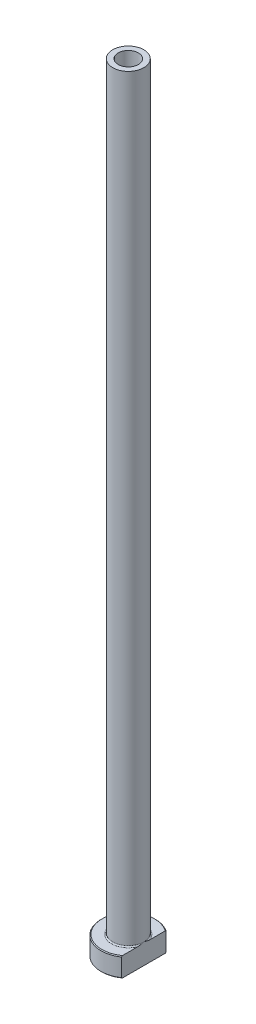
ISO-10303-21;
HEADER;
FILE_DESCRIPTION(('STEP AP214'),'2;1');
FILE_NAME('part.step','',(''),(''),'','','');
FILE_SCHEMA(('AUTOMOTIVE_DESIGN { 1 0 10303 214 1 1 1 1 }'));
ENDSEC;
DATA;
#1=APPLICATION_CONTEXT('core data for automotive mechanical design processes');
#2=APPLICATION_PROTOCOL_DEFINITION('international standard','automotive_design',2000,#1);
#3=PRODUCT_CONTEXT('',#1,'mechanical');
#4=PRODUCT('Part','Part','',(#3));
#5=PRODUCT_RELATED_PRODUCT_CATEGORY('part','',(#4));
#6=PRODUCT_DEFINITION_FORMATION('','',#4);
#7=PRODUCT_DEFINITION_CONTEXT('part definition',#1,'design');
#8=PRODUCT_DEFINITION('design','',#6,#7);
#9=PRODUCT_DEFINITION_SHAPE('','',#8);
#10=(LENGTH_UNIT() NAMED_UNIT(*) SI_UNIT(.MILLI.,.METRE.));
#11=(NAMED_UNIT(*) PLANE_ANGLE_UNIT() SI_UNIT($,.RADIAN.));
#12=(NAMED_UNIT(*) SI_UNIT($,.STERADIAN.) SOLID_ANGLE_UNIT());
#13=UNCERTAINTY_MEASURE_WITH_UNIT(LENGTH_MEASURE(1.E-05),#10,'distance_accuracy_value','');
#14=(GEOMETRIC_REPRESENTATION_CONTEXT(3) GLOBAL_UNCERTAINTY_ASSIGNED_CONTEXT((#13)) GLOBAL_UNIT_ASSIGNED_CONTEXT((#10,
#11,#12)) REPRESENTATION_CONTEXT('',''));
#15=CARTESIAN_POINT('',(0.,0.,0.));
#16=DIRECTION('',(0.,0.,1.));
#17=DIRECTION('',(1.,0.,0.));
#18=AXIS2_PLACEMENT_3D('',#15,#16,#17);
#19=CARTESIAN_POINT('',(0.,92.1876809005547,0.));
#20=DIRECTION('',(0.,1.,0.));
#21=DIRECTION('',(0.,0.,1.));
#22=AXIS2_PLACEMENT_3D('',#19,#20,#21);
#23=CYLINDRICAL_SURFACE('',#22,2.6);
#24=CARTESIAN_POINT('',(0.,200.,0.));
#25=DIRECTION('',(0.,1.,0.));
#26=DIRECTION('',(0.,0.,1.));
#27=AXIS2_PLACEMENT_3D('',#24,#25,#26);
#28=CIRCLE('',#27,2.6);
#29=CARTESIAN_POINT('',(0.,200.,2.6));
#30=VERTEX_POINT('',#29);
#31=EDGE_CURVE('E167',#30,#30,#28,.T.);
#32=ORIENTED_EDGE('',*,*,#31,.T.);
#33=EDGE_LOOP('',(#32));
#34=FACE_BOUND('',#33,.T.);
#35=CARTESIAN_POINT('',(0.,155.,0.));
#36=DIRECTION('',(0.,1.,0.));
#37=DIRECTION('',(0.,0.,1.));
#38=AXIS2_PLACEMENT_3D('',#35,#36,#37);
#39=CIRCLE('',#38,2.6);
#40=CARTESIAN_POINT('',(0.,155.,2.6));
#41=VERTEX_POINT('',#40);
#42=EDGE_CURVE('E170',#41,#41,#39,.T.);
#43=ORIENTED_EDGE('',*,*,#42,.F.);
#44=EDGE_LOOP('',(#43));
#45=FACE_BOUND('',#44,.T.);
#46=ADVANCED_FACE('F32',(#34,#45),#23,.F.);
#47=CARTESIAN_POINT('',(-2.6,200.,0.));
#48=DIRECTION('',(0.,1.,0.));
#49=DIRECTION('',(0.,0.,1.));
#50=AXIS2_PLACEMENT_3D('',#47,#48,#49);
#51=PLANE('',#50);
#52=CARTESIAN_POINT('',(0.,200.,0.));
#53=DIRECTION('',(0.,1.,0.));
#54=DIRECTION('',(0.,0.,1.));
#55=AXIS2_PLACEMENT_3D('',#52,#53,#54);
#56=CIRCLE('',#55,4.00000000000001);
#57=CARTESIAN_POINT('',(0.,200.,4.00000000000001));
#58=VERTEX_POINT('',#57);
#59=EDGE_CURVE('E174',#58,#58,#56,.T.);
#60=ORIENTED_EDGE('',*,*,#59,.T.);
#61=EDGE_LOOP('',(#60));
#62=FACE_BOUND('',#61,.T.);
#63=ORIENTED_EDGE('',*,*,#31,.F.);
#64=EDGE_LOOP('',(#63));
#65=FACE_BOUND('',#64,.T.);
#66=ADVANCED_FACE('F157',(#62,#65),#51,.T.);
#67=CARTESIAN_POINT('',(0.,92.1876809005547,0.));
#68=DIRECTION('',(0.,1.,0.));
#69=DIRECTION('',(0.,0.,1.));
#70=AXIS2_PLACEMENT_3D('',#67,#68,#69);
#71=CYLINDRICAL_SURFACE('',#70,4.);
#72=CARTESIAN_POINT('',(0.,5.3,0.));
#73=DIRECTION('',(0.,1.,0.));
#74=DIRECTION('',(0.,0.,1.));
#75=AXIS2_PLACEMENT_3D('',#72,#73,#74);
#76=CIRCLE('',#75,4.);
#77=CARTESIAN_POINT('',(4.,5.3,0.));
#78=VERTEX_POINT('',#77);
#79=EDGE_CURVE('E180',#78,#78,#76,.T.);
#80=ORIENTED_EDGE('',*,*,#79,.T.);
#81=EDGE_LOOP('',(#80));
#82=FACE_BOUND('',#81,.T.);
#83=ORIENTED_EDGE('',*,*,#59,.F.);
#84=EDGE_LOOP('',(#83));
#85=FACE_BOUND('',#84,.T.);
#86=ADVANCED_FACE('F162',(#82,#85),#71,.T.);
#87=CARTESIAN_POINT('',(-3.99999999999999,5.,0.));
#88=DIRECTION('',(0.,1.,0.));
#89=DIRECTION('',(0.,0.,1.));
#90=AXIS2_PLACEMENT_3D('',#87,#88,#89);
#91=PLANE('',#90);
#92=DIRECTION('',(0.,0.,1.));
#93=VECTOR('',#92,1.);
#94=CARTESIAN_POINT('',(4.,5.,0.));
#95=LINE('',#94,#93);
#96=CARTESIAN_POINT('',(4.,5.,-5.49909083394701));
#97=VERTEX_POINT('',#96);
#98=CARTESIAN_POINT('',(4.,5.,-1.57797338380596));
#99=VERTEX_POINT('',#98);
#100=EDGE_CURVE('E54',#97,#99,#95,.T.);
#101=ORIENTED_EDGE('',*,*,#100,.F.);
#102=CARTESIAN_POINT('',(0.,5.,0.));
#103=DIRECTION('',(0.,1.,0.));
#104=DIRECTION('',(0.,0.,1.));
#105=AXIS2_PLACEMENT_3D('',#102,#103,#104);
#106=CIRCLE('',#105,6.8);
#107=CARTESIAN_POINT('',(3.99999999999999,5.,5.49909083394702));
#108=VERTEX_POINT('',#107);
#109=EDGE_CURVE('E186',#97,#108,#106,.T.);
#110=ORIENTED_EDGE('',*,*,#109,.T.);
#111=CARTESIAN_POINT('',(4.,5.,1.57797338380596));
#112=VERTEX_POINT('',#111);
#113=EDGE_CURVE('E134',#112,#108,#95,.T.);
#114=ORIENTED_EDGE('',*,*,#113,.F.);
#115=CARTESIAN_POINT('',(0.,5.,0.));
#116=DIRECTION('',(0.,1.,0.));
#117=DIRECTION('',(0.,0.,1.));
#118=AXIS2_PLACEMENT_3D('',#115,#116,#117);
#119=CIRCLE('',#118,4.3);
#120=EDGE_CURVE('E183',#112,#99,#119,.F.);
#121=ORIENTED_EDGE('',*,*,#120,.T.);
#122=EDGE_LOOP('',(#101,#110,#114,#121));
#123=FACE_BOUND('',#122,.T.);
#124=ADVANCED_FACE('F197',(#123),#91,.T.);
#125=CARTESIAN_POINT('',(0.,92.1876809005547,0.));
#126=DIRECTION('',(0.,1.,0.));
#127=DIRECTION('',(0.,0.,1.));
#128=AXIS2_PLACEMENT_3D('',#125,#126,#127);
#129=CYLINDRICAL_SURFACE('',#128,6.99999999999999);
#130=DIRECTION('',(0.,-1.,0.));
#131=VECTOR('',#130,1.);
#132=CARTESIAN_POINT('',(3.99999999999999,200.,5.74456264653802));
#133=LINE('',#132,#131);
#134=CARTESIAN_POINT('',(3.99999999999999,4.8,5.74456264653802));
#135=VERTEX_POINT('',#134);
#136=CARTESIAN_POINT('',(3.99999999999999,0.20000000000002,5.74456264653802));
#137=VERTEX_POINT('',#136);
#138=EDGE_CURVE('E82',#135,#137,#133,.T.);
#139=ORIENTED_EDGE('',*,*,#138,.F.);
#140=CARTESIAN_POINT('',(0.,4.8,0.));
#141=DIRECTION('',(0.,1.,0.));
#142=DIRECTION('',(0.,0.,1.));
#143=AXIS2_PLACEMENT_3D('',#140,#141,#142);
#144=CIRCLE('',#143,6.99999999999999);
#145=CARTESIAN_POINT('',(4.,4.8,-5.74456264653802));
#146=VERTEX_POINT('',#145);
#147=EDGE_CURVE('E95',#135,#146,#144,.F.);
#148=ORIENTED_EDGE('',*,*,#147,.T.);
#149=DIRECTION('',(0.,-1.,0.));
#150=VECTOR('',#149,1.);
#151=CARTESIAN_POINT('',(4.,200.,-5.74456264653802));
#152=LINE('',#151,#150);
#153=CARTESIAN_POINT('',(4.,0.20000000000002,-5.74456264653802));
#154=VERTEX_POINT('',#153);
#155=EDGE_CURVE('E192',#146,#154,#152,.T.);
#156=ORIENTED_EDGE('',*,*,#155,.T.);
#157=CARTESIAN_POINT('',(0.,0.20000000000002,0.));
#158=DIRECTION('',(0.,-1.,0.));
#159=DIRECTION('',(0.,0.,-1.));
#160=AXIS2_PLACEMENT_3D('',#157,#158,#159);
#161=CIRCLE('',#160,6.99999999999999);
#162=EDGE_CURVE('E98',#154,#137,#161,.F.);
#163=ORIENTED_EDGE('',*,*,#162,.T.);
#164=EDGE_LOOP('',(#139,#148,#156,#163));
#165=FACE_BOUND('',#164,.T.);
#166=ADVANCED_FACE('F190',(#165),#129,.T.);
#167=CARTESIAN_POINT('',(-6.99999999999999,0.,0.));
#168=DIRECTION('',(0.,-1.,0.));
#169=DIRECTION('',(0.,0.,-1.));
#170=AXIS2_PLACEMENT_3D('',#167,#168,#169);
#171=PLANE('',#170);
#172=CARTESIAN_POINT('',(0.,0.,0.));
#173=DIRECTION('',(0.,-1.,0.));
#174=DIRECTION('',(0.,0.,-1.));
#175=AXIS2_PLACEMENT_3D('',#172,#173,#174);
#176=CIRCLE('',#175,3.34999999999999);
#177=CARTESIAN_POINT('',(0.,0.,-3.34999999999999));
#178=VERTEX_POINT('',#177);
#179=EDGE_CURVE('E40',#178,#178,#176,.F.);
#180=ORIENTED_EDGE('',*,*,#179,.T.);
#181=EDGE_LOOP('',(#180));
#182=FACE_BOUND('',#181,.T.);
#183=DIRECTION('',(0.,0.,-1.));
#184=VECTOR('',#183,1.);
#185=CARTESIAN_POINT('',(3.99999999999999,0.,5.74456264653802));
#186=LINE('',#185,#184);
#187=CARTESIAN_POINT('',(3.99999999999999,0.,5.49909083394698));
#188=VERTEX_POINT('',#187);
#189=CARTESIAN_POINT('',(4.,0.,-5.49909083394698));
#190=VERTEX_POINT('',#189);
#191=EDGE_CURVE('E47',#188,#190,#186,.T.);
#192=ORIENTED_EDGE('',*,*,#191,.F.);
#193=CARTESIAN_POINT('',(0.,0.,0.));
#194=DIRECTION('',(0.,-1.,0.));
#195=DIRECTION('',(0.,0.,-1.));
#196=AXIS2_PLACEMENT_3D('',#193,#194,#195);
#197=CIRCLE('',#196,6.79999999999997);
#198=EDGE_CURVE('E92',#188,#190,#197,.T.);
#199=ORIENTED_EDGE('',*,*,#198,.T.);
#200=EDGE_LOOP('',(#192,#199));
#201=FACE_BOUND('',#200,.T.);
#202=ADVANCED_FACE('F91',(#182,#201),#171,.T.);
#203=CARTESIAN_POINT('',(0.,92.1876809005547,0.));
#204=DIRECTION('',(0.,1.,0.));
#205=DIRECTION('',(0.,0.,1.));
#206=AXIS2_PLACEMENT_3D('',#203,#204,#205);
#207=CYLINDRICAL_SURFACE('',#206,2.85);
#208=CARTESIAN_POINT('',(0.,0.500000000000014,0.));
#209=DIRECTION('',(0.,-1.,0.));
#210=DIRECTION('',(0.,0.,-1.));
#211=AXIS2_PLACEMENT_3D('',#208,#209,#210);
#212=CIRCLE('',#211,2.85);
#213=CARTESIAN_POINT('',(0.,0.500000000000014,-2.85));
#214=VERTEX_POINT('',#213);
#215=EDGE_CURVE('E11',#214,#214,#212,.T.);
#216=ORIENTED_EDGE('',*,*,#215,.T.);
#217=EDGE_LOOP('',(#216));
#218=FACE_BOUND('',#217,.T.);
#219=CARTESIAN_POINT('',(0.,143.,0.));
#220=DIRECTION('',(0.,1.,0.));
#221=DIRECTION('',(0.,0.,1.));
#222=AXIS2_PLACEMENT_3D('',#219,#220,#221);
#223=CIRCLE('',#222,2.85000000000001);
#224=CARTESIAN_POINT('',(0.,143.,2.85000000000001));
#225=VERTEX_POINT('',#224);
#226=EDGE_CURVE('E172',#225,#225,#223,.T.);
#227=ORIENTED_EDGE('',*,*,#226,.T.);
#228=EDGE_LOOP('',(#227));
#229=FACE_BOUND('',#228,.T.);
#230=ADVANCED_FACE('F215',(#218,#229),#207,.F.);
#231=CARTESIAN_POINT('',(0.,143.,0.));
#232=DIRECTION('',(0.,-1.,0.));
#233=DIRECTION('',(0.,0.,-1.));
#234=AXIS2_PLACEMENT_3D('',#231,#232,#233);
#235=CONICAL_SURFACE('',#234,2.85000000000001,0.0208303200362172);
#236=ORIENTED_EDGE('',*,*,#42,.T.);
#237=EDGE_LOOP('',(#236));
#238=FACE_BOUND('',#237,.T.);
#239=ORIENTED_EDGE('',*,*,#226,.F.);
#240=EDGE_LOOP('',(#239));
#241=FACE_BOUND('',#240,.T.);
#242=ADVANCED_FACE('F111',(#238,#241),#235,.F.);
#243=CARTESIAN_POINT('',(0.,5.3,0.));
#244=DIRECTION('',(0.,1.,0.));
#245=DIRECTION('',(0.,0.,1.));
#246=AXIS2_PLACEMENT_3D('',#243,#244,#245);
#247=TOROIDAL_SURFACE('',#246,4.3,0.3);
#248=ORIENTED_EDGE('',*,*,#120,.F.);
#249=CARTESIAN_POINT('',(4.,5.3,0.));
#250=CARTESIAN_POINT('',(4.,5.30000062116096,-1.06261387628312E-10));
#251=CARTESIAN_POINT('',(4.,5.30000124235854,2.17726101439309E-07));
#252=CARTESIAN_POINT('',(4.,5.30000240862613,8.36141079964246E-07));
#253=CARTESIAN_POINT('',(4.,5.30000294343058,1.25011689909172E-06));
#254=CARTESIAN_POINT('',(4.,5.30000404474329,2.23959350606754E-06));
#255=CARTESIAN_POINT('',(4.,5.30000459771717,2.83084478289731E-06));
#256=CARTESIAN_POINT('',(4.,5.30000559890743,4.06516620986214E-06));
#257=CARTESIAN_POINT('',(4.,5.30000604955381,4.70640099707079E-06));
#258=CARTESIAN_POINT('',(4.,5.3000076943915,7.15677236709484E-06));
#259=CARTESIAN_POINT('',(4.,5.30000879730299,9.02996012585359E-06));
#260=CARTESIAN_POINT('',(4.,5.30001063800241,1.27664891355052E-05));
#261=CARTESIAN_POINT('',(4.,5.30001139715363,1.46197810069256E-05));
#262=CARTESIAN_POINT('',(4.,5.30001453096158,2.23679229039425E-05));
#263=CARTESIAN_POINT('',(4.,5.30001683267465,2.82968759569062E-05));
#264=CARTESIAN_POINT('',(4.,5.30002027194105,3.95668741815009E-05));
#265=CARTESIAN_POINT('',(4.,5.30002152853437,4.48715472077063E-05));
#266=CARTESIAN_POINT('',(4.,5.30003060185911,8.40118217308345E-05));
#267=CARTESIAN_POINT('',(4.,5.30003739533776,0.000118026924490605));
#268=CARTESIAN_POINT('',(4.,5.30006713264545,0.000252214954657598));
#269=CARTESIAN_POINT('',(4.,5.30009559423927,0.000351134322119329));
#270=CARTESIAN_POINT('',(3.99999999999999,5.30020622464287,0.000742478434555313));
#271=CARTESIAN_POINT('',(4.,5.30028475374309,0.00103561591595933));
#272=CARTESIAN_POINT('',(4.,5.30059889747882,0.00219920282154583));
#273=CARTESIAN_POINT('',(4.,5.30083905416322,0.00306873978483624));
#274=CARTESIAN_POINT('',(3.99999999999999,5.30183682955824,0.00669141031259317));
#275=CARTESIAN_POINT('',(4.,5.30258877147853,0.00944568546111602));
#276=CARTESIAN_POINT('',(4.,5.31066890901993,0.0390293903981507));
#277=CARTESIAN_POINT('',(4.,5.31802631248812,0.0658531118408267));
#278=CARTESIAN_POINT('',(3.99999999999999,5.33239676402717,0.118441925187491));
#279=CARTESIAN_POINT('',(4.,5.3394118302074,0.144206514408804));
#280=CARTESIAN_POINT('',(4.,5.35427366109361,0.19901759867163));
#281=CARTESIAN_POINT('',(4.,5.36211313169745,0.228066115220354));
#282=CARTESIAN_POINT('',(4.,5.37776349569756,0.286511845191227));
#283=CARTESIAN_POINT('',(4.,5.38557313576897,0.315909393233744));
#284=CARTESIAN_POINT('',(4.,5.40425662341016,0.386994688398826));
#285=CARTESIAN_POINT('',(4.,5.41505237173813,0.428703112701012));
#286=CARTESIAN_POINT('',(4.,5.43592310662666,0.511098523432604));
#287=CARTESIAN_POINT('',(4.,5.4460096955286,0.551782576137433));
#288=CARTESIAN_POINT('',(4.,5.47850986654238,0.686599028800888));
#289=CARTESIAN_POINT('',(4.,5.49978370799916,0.78101186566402));
#290=CARTESIAN_POINT('',(4.,5.53807543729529,0.971847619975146));
#291=CARTESIAN_POINT('',(4.,5.55504273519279,1.06828120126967));
#292=CARTESIAN_POINT('',(4.,5.5758240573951,1.21752725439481));
#293=CARTESIAN_POINT('',(4.,5.5820979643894,1.26999379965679));
#294=CARTESIAN_POINT('',(4.,5.59210686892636,1.37516324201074));
#295=CARTESIAN_POINT('',(4.,5.59584265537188,1.42786606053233));
#296=CARTESIAN_POINT('',(4.,5.60010438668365,1.53310673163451));
#297=CARTESIAN_POINT('',(4.,5.6006487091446,1.58564378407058));
#298=CARTESIAN_POINT('',(4.,5.59767158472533,1.69058605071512));
#299=CARTESIAN_POINT('',(4.,5.59415502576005,1.74299134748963));
#300=CARTESIAN_POINT('',(4.,5.58503062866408,1.81903290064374));
#301=CARTESIAN_POINT('',(4.,5.58157617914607,1.84292934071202));
#302=CARTESIAN_POINT('',(4.,5.57329952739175,1.89051061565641));
#303=CARTESIAN_POINT('',(4.,5.56847619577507,1.91419525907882));
#304=CARTESIAN_POINT('',(4.,5.55726644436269,1.9609288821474));
#305=CARTESIAN_POINT('',(4.,5.550897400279,1.98398195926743));
#306=CARTESIAN_POINT('',(4.,5.53623434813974,2.02945550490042));
#307=CARTESIAN_POINT('',(4.,5.52794253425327,2.05187666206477));
#308=CARTESIAN_POINT('',(4.,5.50887098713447,2.09590631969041));
#309=CARTESIAN_POINT('',(4.,5.49806837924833,2.11750508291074));
#310=CARTESIAN_POINT('',(4.,5.47333401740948,2.15885583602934));
#311=CARTESIAN_POINT('',(4.,5.459412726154,2.17861369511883));
#312=CARTESIAN_POINT('',(4.,5.43588221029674,2.20522942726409));
#313=CARTESIAN_POINT('',(4.,5.42781139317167,2.21344043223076));
#314=CARTESIAN_POINT('',(4.,5.41065114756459,2.22875149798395));
#315=CARTESIAN_POINT('',(4.,5.4015612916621,2.23585108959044));
#316=CARTESIAN_POINT('',(4.,5.38220524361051,2.24859694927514));
#317=CARTESIAN_POINT('',(4.,5.37192420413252,2.25422119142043));
#318=CARTESIAN_POINT('',(4.,5.35045072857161,2.26331064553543));
#319=CARTESIAN_POINT('',(4.,5.33926122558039,2.26678251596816));
#320=CARTESIAN_POINT('',(4.,5.3195204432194,2.2705126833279));
#321=CARTESIAN_POINT('',(4.,5.31108453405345,2.27139016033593));
#322=CARTESIAN_POINT('',(4.,5.29418624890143,2.27168963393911));
#323=CARTESIAN_POINT('',(4.,5.2857238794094,2.27111196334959));
#324=CARTESIAN_POINT('',(4.,5.26904138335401,2.26855580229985));
#325=CARTESIAN_POINT('',(4.,5.26082066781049,2.26658107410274));
#326=CARTESIAN_POINT('',(4.,5.24478214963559,2.26139496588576));
#327=CARTESIAN_POINT('',(4.,5.23696461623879,2.25818277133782));
#328=CARTESIAN_POINT('',(4.,5.2185123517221,2.24908332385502));
#329=CARTESIAN_POINT('',(4.,5.20815219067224,2.24264095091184));
#330=CARTESIAN_POINT('',(4.,5.18857975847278,2.22819957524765));
#331=CARTESIAN_POINT('',(4.,5.17937061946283,2.22019647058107));
#332=CARTESIAN_POINT('',(4.,5.15665383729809,2.19777756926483));
#333=CARTESIAN_POINT('',(4.,5.14403484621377,2.18246908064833));
#334=CARTESIAN_POINT('',(4.,5.12118369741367,2.15020843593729));
#335=CARTESIAN_POINT('',(4.,5.11095480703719,2.13325407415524));
#336=CARTESIAN_POINT('',(4.,5.09273574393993,2.09892324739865));
#337=CARTESIAN_POINT('',(4.,5.08468212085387,2.08157988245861));
#338=CARTESIAN_POINT('',(4.,5.07005901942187,2.04627072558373));
#339=CARTESIAN_POINT('',(4.,5.06349101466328,2.02830433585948));
#340=CARTESIAN_POINT('',(4.,5.04555485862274,1.9735076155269));
#341=CARTESIAN_POINT('',(4.,5.03608974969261,1.93605770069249));
#342=CARTESIAN_POINT('',(4.,5.01780569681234,1.84529235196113));
#343=CARTESIAN_POINT('',(4.,5.01077018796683,1.79164082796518));
#344=CARTESIAN_POINT('',(4.,5.00182846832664,1.68379947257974));
#345=CARTESIAN_POINT('',(4.,4.99993887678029,1.62960846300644));
#346=CARTESIAN_POINT('',(4.,5.0000612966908,1.52361204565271));
#347=CARTESIAN_POINT('',(4.,5.00190698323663,1.47180551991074));
#348=CARTESIAN_POINT('',(4.,5.00841243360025,1.36835357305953));
#349=CARTESIAN_POINT('',(4.,5.01307376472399,1.31670825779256));
#350=CARTESIAN_POINT('',(4.,5.02905484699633,1.17431887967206));
#351=CARTESIAN_POINT('',(4.,5.04274090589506,1.08384207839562));
#352=CARTESIAN_POINT('',(4.,5.06701714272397,0.9477579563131));
#353=CARTESIAN_POINT('',(4.,5.07585573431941,0.90181406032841));
#354=CARTESIAN_POINT('',(4.,5.09458665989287,0.810008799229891));
#355=CARTESIAN_POINT('',(4.,5.10448180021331,0.764148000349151));
#356=CARTESIAN_POINT('',(4.,5.12892434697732,0.655631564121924));
#357=CARTESIAN_POINT('',(4.,5.14383556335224,0.593058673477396));
#358=CARTESIAN_POINT('',(4.,5.17458762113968,0.468885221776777));
#359=CARTESIAN_POINT('',(4.,5.19041623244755,0.407281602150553));
#360=CARTESIAN_POINT('',(3.99999999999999,5.22090834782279,0.291232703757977));
#361=CARTESIAN_POINT('',(3.99999999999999,5.23550024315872,0.236768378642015));
#362=CARTESIAN_POINT('',(4.,5.26562550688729,0.125604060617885));
#363=CARTESIAN_POINT('',(4.,5.28117250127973,0.0689076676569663));
#364=CARTESIAN_POINT('',(4.,5.29741226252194,0.00944154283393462));
#365=CARTESIAN_POINT('',(3.99999999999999,5.29816540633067,0.0066831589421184));
#366=CARTESIAN_POINT('',(4.,5.29916346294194,0.0030595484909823));
#367=CARTESIAN_POINT('',(4.,5.2994027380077,0.00219318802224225));
#368=CARTESIAN_POINT('',(4.,5.29971580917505,0.00103357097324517));
#369=CARTESIAN_POINT('',(3.99999999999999,5.29979412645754,0.000741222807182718));
#370=CARTESIAN_POINT('',(4.,5.29990450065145,0.00035080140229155));
#371=CARTESIAN_POINT('',(4.,5.29993292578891,0.000252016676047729));
#372=CARTESIAN_POINT('',(4.,5.2999626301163,0.000117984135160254));
#373=CARTESIAN_POINT('',(4.,5.29996941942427,8.39881910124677E-05));
#374=CARTESIAN_POINT('',(4.,5.29997848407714,4.48674022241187E-05));
#375=CARTESIAN_POINT('',(4.,5.29997973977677,3.95638197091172E-05));
#376=CARTESIAN_POINT('',(4.,5.29998317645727,2.82960343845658E-05));
#377=CARTESIAN_POINT('',(4.,5.29998547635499,2.23681459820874E-05));
#378=CARTESIAN_POINT('',(4.,5.2999886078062,1.46211003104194E-05));
#379=CARTESIAN_POINT('',(4.,5.29998936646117,1.27678901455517E-05));
#380=CARTESIAN_POINT('',(4.,5.29999120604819,9.03144064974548E-06));
#381=CARTESIAN_POINT('',(4.,5.29999230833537,7.15824096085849E-06));
#382=CARTESIAN_POINT('',(4.,5.29999395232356,4.70775527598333E-06));
#383=CARTESIAN_POINT('',(4.,5.29999440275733,4.06646391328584E-06));
#384=CARTESIAN_POINT('',(4.,5.29999540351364,2.83199096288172E-06));
#385=CARTESIAN_POINT('',(4.,5.29999595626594,2.24064351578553E-06));
#386=CARTESIAN_POINT('',(4.,5.29999705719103,1.25093979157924E-06));
#387=CARTESIAN_POINT('',(4.,5.29999759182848,8.36841135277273E-07));
#388=CARTESIAN_POINT('',(4.,5.29999875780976,2.18117782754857E-07));
#389=CARTESIAN_POINT('',(4.,5.29999937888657,1.06254464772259E-10));
#390=CARTESIAN_POINT('',(4.,5.3,0.));
#391=B_SPLINE_CURVE_WITH_KNOTS('',3,(#249,#250,#251,#252,#253,#254,#255,#256,#257,#258,#259,
#260,#261,#262,#263,#264,#265,#266,#267,#268,#269,#270,#271,#272,#273,#274,#275,#276,#277,#278,
#279,#280,#281,#282,#283,#284,#285,#286,#287,#288,#289,#290,#291,#292,#293,#294,#295,#296,#297,
#298,#299,#300,#301,#302,#303,#304,#305,#306,#307,#308,#309,#310,#311,#312,#313,#314,#315,#316,
#317,#318,#319,#320,#321,#322,#323,#324,#325,#326,#327,#328,#329,#330,#331,#332,#333,#334,#335,
#336,#337,#338,#339,#340,#341,#342,#343,#344,#345,#346,#347,#348,#349,#350,#351,#352,#353,#354,
#355,#356,#357,#358,#359,#360,#361,#362,#363,#364,#365,#366,#367,#368,#369,#370,#371,#372,#373,
#374,#375,#376,#377,#378,#379,#380,#381,#382,#383,#384,#385,#386,#387,#388,#389,#390),
.UNSPECIFIED.,.T.,.F.,(4,2,2,2,2,2,2,2,2,2,2,2,2,2,2,2,2,2,2,2,2,2,2,2,2,2,2,2,2,2,2,2,2,2,2,2,
2,2,2,2,2,2,2,2,2,2,2,2,2,2,2,2,2,2,2,2,2,2,2,2,2,2,2,2,2,2,2,2,2,2,4),(0.,1.87484395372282E-06,
3.90179990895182E-06,6.31683803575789E-06,8.66651934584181E-06,1.51627551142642E-05,
2.11657928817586E-05,4.02090773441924E-05,5.65429468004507E-05,0.000160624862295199,
0.000469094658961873,0.00137985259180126,0.0040857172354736,0.0126514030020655,
0.0960918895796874,0.176200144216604,0.266463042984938,0.357714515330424,0.486961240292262,
0.612707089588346,0.902988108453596,1.19653589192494,1.35501075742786,1.51343634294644,
1.67094875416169,1.82827177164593,1.90067591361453,1.97313996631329,2.04482437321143,
2.11642737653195,2.18871023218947,2.26075412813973,2.29521947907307,2.32969934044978,
2.36466792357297,2.39952778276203,2.4248542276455,2.45017488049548,2.47542760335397,
2.5006969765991,2.53708899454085,2.57357798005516,2.63276032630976,2.69202310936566,
2.74930315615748,2.80663977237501,2.92223125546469,3.08420752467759,3.24670629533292,
3.4021285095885,3.55763731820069,3.83192962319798,3.9722838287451,4.11302057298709,
4.30598130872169,4.4967888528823,4.66594443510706,4.84230602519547,4.85088453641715,
4.85358051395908,4.85448881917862,4.85479687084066,4.85490089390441,4.85491722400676,
4.85493626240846,4.85494226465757,4.85494875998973,4.85495110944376,4.85495352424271,
4.85495555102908,4.85495742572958),.UNSPECIFIED.);
#392=EDGE_CURVE('E126',#112,#78,#391,.T.);
#393=ORIENTED_EDGE('',*,*,#392,.T.);
#394=ORIENTED_EDGE('',*,*,#79,.F.);
#395=CARTESIAN_POINT('',(4.,5.3,0.));
#396=CARTESIAN_POINT('',(4.,5.29999937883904,1.06262478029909E-10));
#397=CARTESIAN_POINT('',(4.,5.29999875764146,-2.17726100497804E-07));
#398=CARTESIAN_POINT('',(4.,5.29999759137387,-8.36141079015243E-07));
#399=CARTESIAN_POINT('',(4.,5.29999705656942,-1.25011689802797E-06));
#400=CARTESIAN_POINT('',(4.,5.29999595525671,-2.2395935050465E-06));
#401=CARTESIAN_POINT('',(4.,5.29999540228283,-2.83084478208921E-06));
#402=CARTESIAN_POINT('',(4.,5.29999440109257,-4.06516620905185E-06));
#403=CARTESIAN_POINT('',(4.,5.29999395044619,-4.70640099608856E-06));
#404=CARTESIAN_POINT('',(4.,5.2999923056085,-7.15677236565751E-06));
#405=CARTESIAN_POINT('',(4.,5.29999120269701,-9.02996012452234E-06));
#406=CARTESIAN_POINT('',(4.,5.29998936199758,-1.27664891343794E-05));
#407=CARTESIAN_POINT('',(4.,5.29998860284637,-1.46197810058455E-05));
#408=CARTESIAN_POINT('',(4.,5.29998546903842,-2.23679229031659E-05));
#409=CARTESIAN_POINT('',(4.,5.29998316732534,-2.82968759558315E-05));
#410=CARTESIAN_POINT('',(4.,5.29997972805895,-3.95668741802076E-05));
#411=CARTESIAN_POINT('',(4.,5.29997847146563,-4.48715472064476E-05));
#412=CARTESIAN_POINT('',(4.,5.29996939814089,-8.40118217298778E-05));
#413=CARTESIAN_POINT('',(4.,5.29996260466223,-0.000118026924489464));
#414=CARTESIAN_POINT('',(4.,5.29993286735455,-0.000252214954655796));
#415=CARTESIAN_POINT('',(4.,5.29990440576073,-0.000351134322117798));
#416=CARTESIAN_POINT('',(3.99999999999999,5.29979377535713,-0.000742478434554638));
#417=CARTESIAN_POINT('',(4.,5.29971524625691,-0.00103561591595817));
#418=CARTESIAN_POINT('',(4.,5.29940110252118,-0.0021992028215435));
#419=CARTESIAN_POINT('',(4.,5.29916094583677,-0.00306873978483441));
#420=CARTESIAN_POINT('',(3.99999999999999,5.29816317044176,-0.00669141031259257));
#421=CARTESIAN_POINT('',(4.,5.29741122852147,-0.00944568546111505));
#422=CARTESIAN_POINT('',(4.,5.28933109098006,-0.0390293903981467));
#423=CARTESIAN_POINT('',(4.,5.28197368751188,-0.0658531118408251));
#424=CARTESIAN_POINT('',(3.99999999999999,5.26760323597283,-0.118441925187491));
#425=CARTESIAN_POINT('',(4.,5.2605881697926,-0.144206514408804));
#426=CARTESIAN_POINT('',(4.,5.24572633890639,-0.19901759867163));
#427=CARTESIAN_POINT('',(4.,5.23788686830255,-0.228066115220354));
#428=CARTESIAN_POINT('',(4.,5.22223650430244,-0.286511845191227));
#429=CARTESIAN_POINT('',(4.,5.21442686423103,-0.315909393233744));
#430=CARTESIAN_POINT('',(4.,5.19574337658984,-0.386994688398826));
#431=CARTESIAN_POINT('',(4.,5.18494762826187,-0.428703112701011));
#432=CARTESIAN_POINT('',(4.,5.16407689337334,-0.511098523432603));
#433=CARTESIAN_POINT('',(4.,5.1539903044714,-0.551782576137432));
#434=CARTESIAN_POINT('',(4.,5.12149013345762,-0.686599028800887));
#435=CARTESIAN_POINT('',(4.,5.10021629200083,-0.781011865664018));
#436=CARTESIAN_POINT('',(4.,5.06192456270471,-0.971847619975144));
#437=CARTESIAN_POINT('',(4.,5.04495726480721,-1.06828120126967));
#438=CARTESIAN_POINT('',(4.,5.0241759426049,-1.2175272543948));
#439=CARTESIAN_POINT('',(4.,5.0179020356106,-1.26999379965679));
#440=CARTESIAN_POINT('',(4.,5.00789313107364,-1.37516324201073));
#441=CARTESIAN_POINT('',(4.,5.00415734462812,-1.42786606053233));
#442=CARTESIAN_POINT('',(4.,4.99989561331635,-1.53310673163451));
#443=CARTESIAN_POINT('',(4.,4.9993512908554,-1.58564378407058));
#444=CARTESIAN_POINT('',(4.,5.00232841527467,-1.69058605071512));
#445=CARTESIAN_POINT('',(4.,5.00584497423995,-1.74299134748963));
#446=CARTESIAN_POINT('',(4.,5.01496937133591,-1.81903290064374));
#447=CARTESIAN_POINT('',(4.,5.01842382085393,-1.84292934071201));
#448=CARTESIAN_POINT('',(4.,5.02670047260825,-1.89051061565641));
#449=CARTESIAN_POINT('',(4.,5.03152380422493,-1.91419525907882));
#450=CARTESIAN_POINT('',(4.,5.04273355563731,-1.96092888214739));
#451=CARTESIAN_POINT('',(4.,5.049102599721,-1.98398195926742));
#452=CARTESIAN_POINT('',(4.,5.06376565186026,-2.02945550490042));
#453=CARTESIAN_POINT('',(4.,5.07205746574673,-2.05187666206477));
#454=CARTESIAN_POINT('',(4.,5.09112901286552,-2.0959063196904));
#455=CARTESIAN_POINT('',(4.,5.10193162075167,-2.11750508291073));
#456=CARTESIAN_POINT('',(4.,5.12666598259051,-2.15885583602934));
#457=CARTESIAN_POINT('',(4.,5.140587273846,-2.17861369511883));
#458=CARTESIAN_POINT('',(4.,5.16411778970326,-2.20522942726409));
#459=CARTESIAN_POINT('',(4.,5.17218860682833,-2.21344043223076));
#460=CARTESIAN_POINT('',(4.,5.18934885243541,-2.22875149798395));
#461=CARTESIAN_POINT('',(4.,5.1984387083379,-2.23585108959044));
#462=CARTESIAN_POINT('',(4.,5.21779475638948,-2.24859694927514));
#463=CARTESIAN_POINT('',(4.,5.22807579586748,-2.25422119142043));
#464=CARTESIAN_POINT('',(4.,5.24954927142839,-2.26331064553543));
#465=CARTESIAN_POINT('',(4.,5.26073877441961,-2.26678251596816));
#466=CARTESIAN_POINT('',(4.,5.2804795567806,-2.2705126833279));
#467=CARTESIAN_POINT('',(4.,5.28891546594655,-2.27139016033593));
#468=CARTESIAN_POINT('',(4.,5.30581375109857,-2.27168963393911));
#469=CARTESIAN_POINT('',(4.,5.31427612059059,-2.27111196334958));
#470=CARTESIAN_POINT('',(4.,5.33095861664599,-2.26855580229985));
#471=CARTESIAN_POINT('',(4.,5.33917933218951,-2.26658107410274));
#472=CARTESIAN_POINT('',(4.,5.35521785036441,-2.26139496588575));
#473=CARTESIAN_POINT('',(4.,5.36303538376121,-2.25818277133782));
#474=CARTESIAN_POINT('',(4.,5.38148764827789,-2.24908332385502));
#475=CARTESIAN_POINT('',(4.,5.39184780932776,-2.24264095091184));
#476=CARTESIAN_POINT('',(4.,5.41142024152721,-2.22819957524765));
#477=CARTESIAN_POINT('',(4.,5.42062938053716,-2.22019647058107));
#478=CARTESIAN_POINT('',(4.,5.44334616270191,-2.19777756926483));
#479=CARTESIAN_POINT('',(4.,5.45596515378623,-2.18246908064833));
#480=CARTESIAN_POINT('',(4.,5.47881630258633,-2.15020843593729));
#481=CARTESIAN_POINT('',(4.,5.48904519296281,-2.13325407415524));
#482=CARTESIAN_POINT('',(4.,5.50726425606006,-2.09892324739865));
#483=CARTESIAN_POINT('',(4.,5.51531787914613,-2.08157988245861));
#484=CARTESIAN_POINT('',(4.,5.52994098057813,-2.04627072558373));
#485=CARTESIAN_POINT('',(4.,5.53650898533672,-2.02830433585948));
#486=CARTESIAN_POINT('',(4.,5.55444514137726,-1.9735076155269));
#487=CARTESIAN_POINT('',(4.,5.56391025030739,-1.93605770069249));
#488=CARTESIAN_POINT('',(4.,5.58219430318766,-1.84529235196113));
#489=CARTESIAN_POINT('',(4.,5.58922981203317,-1.79164082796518));
#490=CARTESIAN_POINT('',(4.,5.59817153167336,-1.68379947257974));
#491=CARTESIAN_POINT('',(4.,5.60006112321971,-1.62960846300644));
#492=CARTESIAN_POINT('',(4.,5.5999387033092,-1.52361204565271));
#493=CARTESIAN_POINT('',(4.,5.59809301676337,-1.47180551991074));
#494=CARTESIAN_POINT('',(4.,5.59158756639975,-1.36835357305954));
#495=CARTESIAN_POINT('',(4.,5.58692623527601,-1.31670825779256));
#496=CARTESIAN_POINT('',(4.,5.57094515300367,-1.17431887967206));
#497=CARTESIAN_POINT('',(4.,5.55725909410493,-1.08384207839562));
#498=CARTESIAN_POINT('',(4.,5.53298285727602,-0.947757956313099));
#499=CARTESIAN_POINT('',(4.,5.52414426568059,-0.901814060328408));
#500=CARTESIAN_POINT('',(4.,5.50541334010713,-0.81000879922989));
#501=CARTESIAN_POINT('',(4.,5.49551819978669,-0.764148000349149));
#502=CARTESIAN_POINT('',(4.,5.47107565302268,-0.655631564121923));
#503=CARTESIAN_POINT('',(4.,5.45616443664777,-0.593058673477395));
#504=CARTESIAN_POINT('',(4.,5.42541237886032,-0.468885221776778));
#505=CARTESIAN_POINT('',(4.,5.40958376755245,-0.407281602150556));
#506=CARTESIAN_POINT('',(3.99999999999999,5.37909165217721,-0.291232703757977));
#507=CARTESIAN_POINT('',(3.99999999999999,5.3644997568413,-0.236768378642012));
#508=CARTESIAN_POINT('',(4.,5.33437449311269,-0.12560406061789));
#509=CARTESIAN_POINT('',(4.,5.3188274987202,-0.0689076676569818));
#510=CARTESIAN_POINT('',(4.,5.30258773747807,-0.00944154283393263));
#511=CARTESIAN_POINT('',(3.99999999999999,5.30183459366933,-0.0066831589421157));
#512=CARTESIAN_POINT('',(4.,5.30083653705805,-0.00305954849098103));
#513=CARTESIAN_POINT('',(4.,5.3005972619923,-0.00219318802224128));
#514=CARTESIAN_POINT('',(4.,5.30028419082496,-0.00103357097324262));
#515=CARTESIAN_POINT('',(3.99999999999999,5.30020587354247,-0.000741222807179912));
#516=CARTESIAN_POINT('',(4.,5.30009549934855,-0.000350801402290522));
#517=CARTESIAN_POINT('',(4.,5.30006707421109,-0.000252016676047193));
#518=CARTESIAN_POINT('',(4.,5.3000373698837,-0.000117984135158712));
#519=CARTESIAN_POINT('',(4.,5.30003058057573,-8.39881910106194E-05));
#520=CARTESIAN_POINT('',(4.,5.30002151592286,-4.48674022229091E-05));
#521=CARTESIAN_POINT('',(4.,5.30002026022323,-3.95638197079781E-05));
#522=CARTESIAN_POINT('',(4.,5.30001682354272,-2.8296034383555E-05));
#523=CARTESIAN_POINT('',(4.,5.30001452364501,-2.23681459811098E-05));
#524=CARTESIAN_POINT('',(4.,5.3000113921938,-1.46211003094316E-05));
#525=CARTESIAN_POINT('',(4.,5.30001063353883,-1.27678901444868E-05));
#526=CARTESIAN_POINT('',(4.,5.30000879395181,-9.03144064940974E-06));
#527=CARTESIAN_POINT('',(4.,5.30000769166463,-7.15824096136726E-06));
#528=CARTESIAN_POINT('',(4.,5.30000604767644,-4.70775527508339E-06));
#529=CARTESIAN_POINT('',(4.,5.30000559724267,-4.06646391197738E-06));
#530=CARTESIAN_POINT('',(4.,5.30000459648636,-2.83199096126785E-06));
#531=CARTESIAN_POINT('',(4.,5.30000404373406,-2.24064351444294E-06));
#532=CARTESIAN_POINT('',(4.,5.30000294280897,-1.25093979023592E-06));
#533=CARTESIAN_POINT('',(4.,5.30000240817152,-8.36841133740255E-07));
#534=CARTESIAN_POINT('',(4.,5.30000124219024,-2.1811778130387E-07));
#535=CARTESIAN_POINT('',(4.,5.30000062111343,-1.06253139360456E-10));
#536=CARTESIAN_POINT('',(4.,5.3,0.));
#537=B_SPLINE_CURVE_WITH_KNOTS('',3,(#395,#396,#397,#398,#399,#400,#401,#402,#403,#404,#405,
#406,#407,#408,#409,#410,#411,#412,#413,#414,#415,#416,#417,#418,#419,#420,#421,#422,#423,#424,
#425,#426,#427,#428,#429,#430,#431,#432,#433,#434,#435,#436,#437,#438,#439,#440,#441,#442,#443,
#444,#445,#446,#447,#448,#449,#450,#451,#452,#453,#454,#455,#456,#457,#458,#459,#460,#461,#462,
#463,#464,#465,#466,#467,#468,#469,#470,#471,#472,#473,#474,#475,#476,#477,#478,#479,#480,#481,
#482,#483,#484,#485,#486,#487,#488,#489,#490,#491,#492,#493,#494,#495,#496,#497,#498,#499,#500,
#501,#502,#503,#504,#505,#506,#507,#508,#509,#510,#511,#512,#513,#514,#515,#516,#517,#518,#519,
#520,#521,#522,#523,#524,#525,#526,#527,#528,#529,#530,#531,#532,#533,#534,#535,#536),
.UNSPECIFIED.,.T.,.F.,(4,2,2,2,2,2,2,2,2,2,2,2,2,2,2,2,2,2,2,2,2,2,2,2,2,2,2,2,2,2,2,2,2,2,2,2,
2,2,2,2,2,2,2,2,2,2,2,2,2,2,2,2,2,2,2,2,2,2,2,2,2,2,2,2,2,2,2,2,2,2,4),(0.,1.87484395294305E-06,
3.90179990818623E-06,6.31683803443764E-06,8.66651934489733E-06,1.51627551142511E-05,
2.1165792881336E-05,4.02090773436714E-05,5.65429467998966E-05,0.000160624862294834,
0.000469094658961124,0.00137985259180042,0.00408571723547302,0.0126514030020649,
0.0960918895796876,0.176200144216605,0.266463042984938,0.357714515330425,0.486961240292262,
0.612707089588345,0.902988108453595,1.19653589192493,1.35501075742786,1.51343634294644,
1.67094875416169,1.82827177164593,1.90067591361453,1.97313996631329,2.04482437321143,
2.11642737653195,2.18871023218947,2.26075412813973,2.29521947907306,2.32969934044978,
2.36466792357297,2.39952778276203,2.4248542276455,2.45017488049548,2.47542760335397,
2.5006969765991,2.53708899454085,2.57357798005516,2.63276032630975,2.69202310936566,
2.74930315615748,2.80663977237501,2.92223125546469,3.08420752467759,3.24670629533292,
3.4021285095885,3.55763731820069,3.83192962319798,3.9722838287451,4.11302057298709,
4.30598130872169,4.4967888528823,4.66594443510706,4.84230602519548,4.85088453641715,
4.85358051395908,4.85448881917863,4.85479687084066,4.85490089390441,4.85491722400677,
4.85493626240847,4.85494226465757,4.85494875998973,4.85495110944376,4.85495352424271,
4.85495555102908,4.85495742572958),.UNSPECIFIED.);
#538=EDGE_CURVE('E135',#78,#99,#537,.T.);
#539=ORIENTED_EDGE('',*,*,#538,.T.);
#540=EDGE_LOOP('',(#248,#393,#394,#539));
#541=FACE_BOUND('',#540,.T.);
#542=ADVANCED_FACE('F141',(#541),#247,.F.);
#543=CARTESIAN_POINT('',(0.,5.,0.));
#544=DIRECTION('',(0.,-1.,0.));
#545=DIRECTION('',(0.,0.,-1.));
#546=AXIS2_PLACEMENT_3D('',#543,#544,#545);
#547=CONICAL_SURFACE('',#546,6.8,0.785398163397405);
#548=CARTESIAN_POINT('',(4.,-1.45712845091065,-12.6392822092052));
#549=CARTESIAN_POINT('',(4.,-1.24364466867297,-12.4153556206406));
#550=CARTESIAN_POINT('',(4.,-1.03042430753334,-12.1911774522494));
#551=CARTESIAN_POINT('',(4.,-0.604617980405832,-11.7422167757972));
#552=CARTESIAN_POINT('',(4.,-0.392032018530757,-11.5174342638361));
#553=CARTESIAN_POINT('',(4.,0.0324624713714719,-11.0670952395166));
#554=CARTESIAN_POINT('',(4.,0.244370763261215,-10.8415385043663));
#555=CARTESIAN_POINT('',(4.,0.667290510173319,-10.3895875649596));
#556=CARTESIAN_POINT('',(4.,0.878301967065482,-10.1631933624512));
#557=CARTESIAN_POINT('',(4.,1.51385375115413,-9.47810122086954));
#558=CARTESIAN_POINT('',(4.,1.93676291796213,-9.01788214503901));
#559=CARTESIAN_POINT('',(4.,2.56612335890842,-8.32309905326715));
#560=CARTESIAN_POINT('',(4.,2.77505666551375,-8.09078457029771));
#561=CARTESIAN_POINT('',(4.,3.19080254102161,-7.62426940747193));
#562=CARTESIAN_POINT('',(4.,3.39761512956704,-7.39006874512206));
#563=CARTESIAN_POINT('',(4.,3.87870763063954,-6.83891844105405));
#564=CARTESIAN_POINT('',(4.,4.15190978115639,-6.52102188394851));
#565=CARTESIAN_POINT('',(4.,4.55642425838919,-6.03960901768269));
#566=CARTESIAN_POINT('',(4.,4.69041050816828,-5.87833992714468));
#567=CARTESIAN_POINT('',(4.,4.95616531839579,-5.55398469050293));
#568=CARTESIAN_POINT('',(4.,5.08793391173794,-5.39089857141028));
#569=CARTESIAN_POINT('',(4.,5.3484171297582,-5.06288801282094));
#570=CARTESIAN_POINT('',(4.,5.47713786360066,-4.89796843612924));
#571=CARTESIAN_POINT('',(4.,5.73107494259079,-4.56545535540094));
#572=CARTESIAN_POINT('',(4.,5.85629144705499,-4.39786197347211));
#573=CARTESIAN_POINT('',(4.,6.10211465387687,-4.05948444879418));
#574=CARTESIAN_POINT('',(4.,6.22272435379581,-3.88870249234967));
#575=CARTESIAN_POINT('',(4.,6.45796076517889,-3.54308312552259));
#576=CARTESIAN_POINT('',(4.,6.57258867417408,-3.3682465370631));
#577=CARTESIAN_POINT('',(4.,6.76866603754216,-3.05381396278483));
#578=CARTESIAN_POINT('',(4.,6.85173773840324,-2.91523359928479));
#579=CARTESIAN_POINT('',(4.,7.01174537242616,-2.63451965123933));
#580=CARTESIAN_POINT('',(4.,7.08868042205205,-2.49238555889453));
#581=CARTESIAN_POINT('',(4.,7.23459437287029,-2.20416961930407));
#582=CARTESIAN_POINT('',(4.,7.30357836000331,-2.05809037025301));
#583=CARTESIAN_POINT('',(4.,7.43135520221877,-1.7615173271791));
#584=CARTESIAN_POINT('',(4.,7.49015114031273,-1.61102488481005));
#585=CARTESIAN_POINT('',(4.,7.58249315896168,-1.3414209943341));
#586=CARTESIAN_POINT('',(4.,7.61872660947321,-1.22323501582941));
#587=CARTESIAN_POINT('',(4.,7.68223354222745,-0.984492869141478));
#588=CARTESIAN_POINT('',(4.,7.70951040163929,-0.863937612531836));
#589=CARTESIAN_POINT('',(4.,7.75377914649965,-0.621342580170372));
#590=CARTESIAN_POINT('',(4.,7.77080509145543,-0.499309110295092));
#591=CARTESIAN_POINT('',(4.,7.79378778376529,-0.254194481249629));
#592=CARTESIAN_POINT('',(4.,7.79974523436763,-0.131113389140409));
#593=CARTESIAN_POINT('',(4.,7.80023957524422,0.11551726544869));
#594=CARTESIAN_POINT('',(4.,7.79473514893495,0.239066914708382));
#595=CARTESIAN_POINT('',(4.,7.7725511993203,0.485148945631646));
#596=CARTESIAN_POINT('',(4.,7.75587091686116,0.607681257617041));
#597=CARTESIAN_POINT('',(4.,7.71218353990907,0.851269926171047));
#598=CARTESIAN_POINT('',(4.,7.68514362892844,0.972320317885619));
#599=CARTESIAN_POINT('',(4.,7.62201202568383,1.21200276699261));
#600=CARTESIAN_POINT('',(4.,7.58591962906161,1.3306346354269));
#601=CARTESIAN_POINT('',(4.,7.45980070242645,1.70122439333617));
#602=CARTESIAN_POINT('',(4.,7.3557295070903,1.94843335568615));
#603=CARTESIAN_POINT('',(4.,7.18186715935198,2.31048534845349));
#604=CARTESIAN_POINT('',(4.,7.12087684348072,2.42983561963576));
#605=CARTESIAN_POINT('',(4.,6.99403531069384,2.66593629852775));
#606=CARTESIAN_POINT('',(3.99999999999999,6.92818466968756,2.78268701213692));
#607=CARTESIAN_POINT('',(3.99999999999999,6.79157875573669,3.01550895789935));
#608=CARTESIAN_POINT('',(3.99999999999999,6.7207668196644,3.1315466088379));
#609=CARTESIAN_POINT('',(3.99999999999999,6.57583116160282,3.36153379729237));
#610=CARTESIAN_POINT('',(3.99999999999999,6.50170736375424,3.47548328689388));
#611=CARTESIAN_POINT('',(3.99999999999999,6.35080982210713,3.70145107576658));
#612=CARTESIAN_POINT('',(3.99999999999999,6.27403866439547,3.8134711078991));
#613=CARTESIAN_POINT('',(3.99999999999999,6.11824120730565,4.03592316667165));
#614=CARTESIAN_POINT('',(3.99999999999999,6.03921496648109,4.14635523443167));
#615=CARTESIAN_POINT('',(3.99999999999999,5.81506547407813,4.45397159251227));
#616=CARTESIAN_POINT('',(3.99999999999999,5.6678225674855,4.6496112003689));
#617=CARTESIAN_POINT('',(3.99999999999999,5.36880597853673,5.03740600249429));
#618=CARTESIAN_POINT('',(3.99999999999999,5.21703183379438,5.22956083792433));
#619=CARTESIAN_POINT('',(3.99999999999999,4.90999105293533,5.61115465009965));
#620=CARTESIAN_POINT('',(3.99999999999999,4.7547233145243,5.80059273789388));
#621=CARTESIAN_POINT('',(3.99999999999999,4.4415075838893,6.17724364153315));
#622=CARTESIAN_POINT('',(3.99999999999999,4.28355951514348,6.36445639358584));
#623=CARTESIAN_POINT('',(3.99999999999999,3.96525805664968,6.73740614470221));
#624=CARTESIAN_POINT('',(3.99999999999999,3.80490084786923,6.92313987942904));
#625=CARTESIAN_POINT('',(3.99999999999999,3.4824705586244,7.29311320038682));
#626=CARTESIAN_POINT('',(3.99999999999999,3.32039746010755,7.47735277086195));
#627=CARTESIAN_POINT('',(3.99999999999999,2.83216188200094,8.02814826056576));
#628=CARTESIAN_POINT('',(3.99999999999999,2.50391696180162,8.39285790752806));
#629=CARTESIAN_POINT('',(3.99999999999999,1.87512078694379,9.08414492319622));
#630=CARTESIAN_POINT('',(3.99999999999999,1.57491666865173,9.41103929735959));
#631=CARTESIAN_POINT('',(3.99999999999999,0.972153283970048,10.0626830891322));
#632=CARTESIAN_POINT('',(3.99999999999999,0.669593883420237,10.387432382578));
#633=CARTESIAN_POINT('',(3.99999999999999,0.0637759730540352,11.0341169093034));
#634=CARTESIAN_POINT('',(3.99999999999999,-0.239476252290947,11.356058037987));
#635=CARTESIAN_POINT('',(3.99999999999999,-0.847356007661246,11.9985921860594));
#636=CARTESIAN_POINT('',(3.99999999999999,-1.15198342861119,12.3191853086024));
#637=CARTESIAN_POINT('',(3.99999999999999,-1.45712845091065,12.6392822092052));
#638=B_SPLINE_CURVE_WITH_KNOTS('',3,(#548,#549,#550,#551,#552,#553,#554,#555,#556,#557,#558,
#559,#560,#561,#562,#563,#564,#565,#566,#567,#568,#569,#570,#571,#572,#573,#574,#575,#576,#577,
#578,#579,#580,#581,#582,#583,#584,#585,#586,#587,#588,#589,#590,#591,#592,#593,#594,#595,#596,
#597,#598,#599,#600,#601,#602,#603,#604,#605,#606,#607,#608,#609,#610,#611,#612,#613,#614,#615,
#616,#617,#618,#619,#620,#621,#622,#623,#624,#625,#626,#627,#628,#629,#630,#631,#632,#633,#634,
#635,#636,#637),.UNSPECIFIED.,.F.,.F.,(4,2,2,2,2,2,2,2,2,2,2,2,2,2,2,2,2,2,2,2,2,2,2,2,2,2,2,2,
2,2,2,2,2,2,2,2,2,2,2,2,2,2,2,2,4),(0.,0.928152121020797,1.85631024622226,2.78476262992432,
3.71321307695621,5.58823033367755,6.52556078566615,7.46288254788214,8.7202857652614,
9.34927045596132,9.97824580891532,10.6058302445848,11.2333861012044,11.860526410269,
12.4875406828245,12.9721363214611,13.4568016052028,13.9411551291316,14.4253618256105,
14.7959147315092,15.1663277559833,15.5355031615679,15.9046551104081,16.2751400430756,
16.645650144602,17.0173437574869,17.3890663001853,18.1913996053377,18.5934522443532,
18.9954573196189,19.403210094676,19.8109722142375,20.2183467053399,20.625710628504,
21.3601838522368,22.0947322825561,22.8295158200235,23.5643203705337,24.3004480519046,
25.0365834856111,26.5085499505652,27.8400191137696,29.1715646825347,30.4983881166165,
31.8251080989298),.UNSPECIFIED.);
#639=EDGE_CURVE('E133',#146,#97,#638,.T.);
#640=ORIENTED_EDGE('',*,*,#639,.F.);
#641=ORIENTED_EDGE('',*,*,#147,.F.);
#642=EDGE_CURVE('E118',#108,#135,#638,.T.);
#643=ORIENTED_EDGE('',*,*,#642,.F.);
#644=ORIENTED_EDGE('',*,*,#109,.F.);
#645=EDGE_LOOP('',(#640,#641,#643,#644));
#646=FACE_BOUND('',#645,.T.);
#647=ADVANCED_FACE('F145',(#646),#547,.T.);
#648=CARTESIAN_POINT('',(0.,0.20000000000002,0.));
#649=DIRECTION('',(0.,1.,0.));
#650=DIRECTION('',(0.,0.,1.));
#651=AXIS2_PLACEMENT_3D('',#648,#649,#650);
#652=CONICAL_SURFACE('',#651,6.99999999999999,0.78539816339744);
#653=CARTESIAN_POINT('',(3.99999999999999,6.45712845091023,12.6392822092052));
#654=CARTESIAN_POINT('',(3.99999999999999,6.24364466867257,12.4153556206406));
#655=CARTESIAN_POINT('',(3.99999999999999,6.03042430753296,12.1911774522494));
#656=CARTESIAN_POINT('',(3.99999999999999,5.60461798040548,11.7422167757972));
#657=CARTESIAN_POINT('',(3.99999999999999,5.39203201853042,11.5174342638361));
#658=CARTESIAN_POINT('',(3.99999999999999,4.96753752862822,11.0670952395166));
#659=CARTESIAN_POINT('',(3.99999999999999,4.75562923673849,10.8415385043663));
#660=CARTESIAN_POINT('',(3.99999999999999,4.33270948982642,10.3895875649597));
#661=CARTESIAN_POINT('',(3.99999999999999,4.12169803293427,10.1631933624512));
#662=CARTESIAN_POINT('',(3.99999999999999,3.48614624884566,9.47810122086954));
#663=CARTESIAN_POINT('',(3.99999999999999,3.06323708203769,9.01788214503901));
#664=CARTESIAN_POINT('',(3.99999999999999,2.43387664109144,8.32309905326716));
#665=CARTESIAN_POINT('',(3.99999999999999,2.22494333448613,8.09078457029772));
#666=CARTESIAN_POINT('',(3.99999999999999,1.80919745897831,7.62426940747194));
#667=CARTESIAN_POINT('',(3.99999999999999,1.60238487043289,7.39006874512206));
#668=CARTESIAN_POINT('',(3.99999999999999,1.1212923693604,6.83891844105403));
#669=CARTESIAN_POINT('',(3.99999999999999,0.84809021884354,6.52102188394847));
#670=CARTESIAN_POINT('',(3.99999999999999,0.443575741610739,6.0396090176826));
#671=CARTESIAN_POINT('',(3.99999999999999,0.309589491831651,5.87833992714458));
#672=CARTESIAN_POINT('',(3.99999999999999,0.0438346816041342,5.55398469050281));
#673=CARTESIAN_POINT('',(3.99999999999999,-0.0879339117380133,5.39089857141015));
#674=CARTESIAN_POINT('',(3.99999999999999,-0.348417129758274,5.06288801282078));
#675=CARTESIAN_POINT('',(3.99999999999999,-0.477137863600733,4.89796843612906));
#676=CARTESIAN_POINT('',(3.99999999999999,-0.731074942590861,4.56545535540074));
#677=CARTESIAN_POINT('',(3.99999999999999,-0.856291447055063,4.39786197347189));
#678=CARTESIAN_POINT('',(3.99999999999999,-1.10211465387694,4.05948444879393));
#679=CARTESIAN_POINT('',(3.99999999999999,-1.22272435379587,3.88870249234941));
#680=CARTESIAN_POINT('',(3.99999999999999,-1.45796076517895,3.54308312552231));
#681=CARTESIAN_POINT('',(3.99999999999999,-1.57258867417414,3.3682465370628));
#682=CARTESIAN_POINT('',(3.99999999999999,-1.76866603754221,3.0538139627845));
#683=CARTESIAN_POINT('',(4.,-1.85173773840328,2.91523359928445));
#684=CARTESIAN_POINT('',(4.,-2.01174537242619,2.63451965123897));
#685=CARTESIAN_POINT('',(4.,-2.08868042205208,2.49238555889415));
#686=CARTESIAN_POINT('',(4.,-2.23459437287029,2.20416961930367));
#687=CARTESIAN_POINT('',(4.,-2.30357836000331,2.0580903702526));
#688=CARTESIAN_POINT('',(4.,-2.43135520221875,1.76151732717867));
#689=CARTESIAN_POINT('',(4.,-2.49015114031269,1.6110248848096));
#690=CARTESIAN_POINT('',(4.,-2.58249315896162,1.34142099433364));
#691=CARTESIAN_POINT('',(4.,-2.61872660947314,1.22323501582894));
#692=CARTESIAN_POINT('',(4.,-2.68223354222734,0.984492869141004));
#693=CARTESIAN_POINT('',(4.,-2.70951040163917,0.86393761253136));
#694=CARTESIAN_POINT('',(4.,-2.7537791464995,0.621342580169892));
#695=CARTESIAN_POINT('',(4.,-2.77080509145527,0.499309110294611));
#696=CARTESIAN_POINT('',(4.,-2.79378778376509,0.254194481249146));
#697=CARTESIAN_POINT('',(4.,-2.79974523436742,0.131113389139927));
#698=CARTESIAN_POINT('',(4.,-2.80023957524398,-0.115517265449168));
#699=CARTESIAN_POINT('',(4.,-2.79473514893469,-0.239066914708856));
#700=CARTESIAN_POINT('',(4.,-2.77255119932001,-0.485148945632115));
#701=CARTESIAN_POINT('',(4.,-2.75587091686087,-0.607681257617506));
#702=CARTESIAN_POINT('',(4.,-2.71218353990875,-0.851269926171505));
#703=CARTESIAN_POINT('',(4.,-2.68514362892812,-0.972320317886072));
#704=CARTESIAN_POINT('',(4.,-2.62201202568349,-1.21200276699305));
#705=CARTESIAN_POINT('',(4.,-2.58591962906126,-1.33063463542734));
#706=CARTESIAN_POINT('',(4.,-2.45980070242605,-1.7012243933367));
#707=CARTESIAN_POINT('',(4.,-2.35572950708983,-1.94843335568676));
#708=CARTESIAN_POINT('',(4.,-2.18186715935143,-2.31048534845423));
#709=CARTESIAN_POINT('',(4.,-2.12087684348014,-2.42983561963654));
#710=CARTESIAN_POINT('',(4.,-1.99403531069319,-2.66593629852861));
#711=CARTESIAN_POINT('',(4.,-1.92818466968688,-2.78268701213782));
#712=CARTESIAN_POINT('',(4.,-1.79157875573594,-3.01550895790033));
#713=CARTESIAN_POINT('',(4.,-1.72076681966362,-3.13154660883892));
#714=CARTESIAN_POINT('',(4.,-1.57583116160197,-3.36153379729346));
#715=CARTESIAN_POINT('',(4.,-1.50170736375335,-3.47548328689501));
#716=CARTESIAN_POINT('',(4.,-1.35080982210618,-3.70145107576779));
#717=CARTESIAN_POINT('',(4.,-1.27403866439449,-3.81347110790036));
#718=CARTESIAN_POINT('',(4.,-1.1182412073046,-4.03592316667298));
#719=CARTESIAN_POINT('',(4.,-1.03921496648,-4.14635523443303));
#720=CARTESIAN_POINT('',(4.,-0.81506547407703,-4.45397159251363));
#721=CARTESIAN_POINT('',(4.,-0.667822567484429,-4.64961120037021));
#722=CARTESIAN_POINT('',(4.,-0.368805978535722,-5.03740600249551));
#723=CARTESIAN_POINT('',(4.,-0.217031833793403,-5.2295608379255));
#724=CARTESIAN_POINT('',(4.,0.0900089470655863,-5.61115465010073));
#725=CARTESIAN_POINT('',(4.,0.245276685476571,-5.80059273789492));
#726=CARTESIAN_POINT('',(4.,0.558492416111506,-6.17724364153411));
#727=CARTESIAN_POINT('',(4.,0.71644048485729,-6.36445639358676));
#728=CARTESIAN_POINT('',(4.,1.03474194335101,-6.73740614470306));
#729=CARTESIAN_POINT('',(4.,1.19509915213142,-6.92313987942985));
#730=CARTESIAN_POINT('',(4.,1.51752944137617,-7.29311320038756));
#731=CARTESIAN_POINT('',(4.,1.67960253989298,-7.47735277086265));
#732=CARTESIAN_POINT('',(4.,2.16783811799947,-8.02814826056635));
#733=CARTESIAN_POINT('',(4.,2.4960830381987,-8.39285790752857));
#734=CARTESIAN_POINT('',(4.,3.12487921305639,-9.08414492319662));
#735=CARTESIAN_POINT('',(4.,3.4250833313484,-9.41103929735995));
#736=CARTESIAN_POINT('',(4.,4.02784671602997,-10.0626830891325));
#737=CARTESIAN_POINT('',(4.,4.33040611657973,-10.3874323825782));
#738=CARTESIAN_POINT('',(4.,4.93622402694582,-11.0341169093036));
#739=CARTESIAN_POINT('',(4.,5.23947625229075,-11.3560580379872));
#740=CARTESIAN_POINT('',(4.,5.84735600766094,-11.9985921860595));
#741=CARTESIAN_POINT('',(4.,6.15198342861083,-12.3191853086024));
#742=CARTESIAN_POINT('',(4.,6.45712845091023,-12.6392822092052));
#743=B_SPLINE_CURVE_WITH_KNOTS('',3,(#653,#654,#655,#656,#657,#658,#659,#660,#661,#662,#663,
#664,#665,#666,#667,#668,#669,#670,#671,#672,#673,#674,#675,#676,#677,#678,#679,#680,#681,#682,
#683,#684,#685,#686,#687,#688,#689,#690,#691,#692,#693,#694,#695,#696,#697,#698,#699,#700,#701,
#702,#703,#704,#705,#706,#707,#708,#709,#710,#711,#712,#713,#714,#715,#716,#717,#718,#719,#720,
#721,#722,#723,#724,#725,#726,#727,#728,#729,#730,#731,#732,#733,#734,#735,#736,#737,#738,#739,
#740,#741,#742),.UNSPECIFIED.,.F.,.F.,(4,2,2,2,2,2,2,2,2,2,2,2,2,2,2,2,2,2,2,2,2,2,2,2,2,2,2,2,
2,2,2,2,2,2,2,2,2,2,2,2,2,2,2,2,4),(0.,0.928152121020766,1.85631024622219,2.78476262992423,
3.71321307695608,5.58823033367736,6.52556078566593,7.46288254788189,8.72028576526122,
9.34927045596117,9.9782458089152,10.6058302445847,11.2333861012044,11.860526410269,
12.4875406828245,12.9721363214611,13.4568016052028,13.9411551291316,14.4253618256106,
14.7959147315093,15.1663277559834,15.535503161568,15.9046551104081,16.2751400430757,
16.645650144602,17.017343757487,17.3890663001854,18.1913996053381,18.5934522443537,
18.9954573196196,19.4032100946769,19.8109722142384,20.218346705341,20.6257106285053,
21.3601838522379,22.0947322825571,22.8295158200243,23.5643203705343,24.3004480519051,
25.0365834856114,26.5085499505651,27.8400191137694,29.1715646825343,30.4983881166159,
31.8251080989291),.UNSPECIFIED.);
#744=EDGE_CURVE('E79',#137,#188,#743,.T.);
#745=ORIENTED_EDGE('',*,*,#744,.F.);
#746=ORIENTED_EDGE('',*,*,#162,.F.);
#747=EDGE_CURVE('E87',#190,#154,#743,.T.);
#748=ORIENTED_EDGE('',*,*,#747,.F.);
#749=ORIENTED_EDGE('',*,*,#198,.F.);
#750=EDGE_LOOP('',(#745,#746,#748,#749));
#751=FACE_BOUND('',#750,.T.);
#752=ADVANCED_FACE('F94',(#751),#652,.T.);
#753=CARTESIAN_POINT('',(3.99999999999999,200.,5.74456264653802));
#754=DIRECTION('',(-1.,0.,0.));
#755=DIRECTION('',(0.,0.,1.));
#756=AXIS2_PLACEMENT_3D('',#753,#754,#755);
#757=PLANE('',#756);
#758=ORIENTED_EDGE('',*,*,#392,.F.);
#759=ORIENTED_EDGE('',*,*,#113,.T.);
#760=ORIENTED_EDGE('',*,*,#642,.T.);
#761=ORIENTED_EDGE('',*,*,#138,.T.);
#762=ORIENTED_EDGE('',*,*,#744,.T.);
#763=ORIENTED_EDGE('',*,*,#191,.T.);
#764=ORIENTED_EDGE('',*,*,#747,.T.);
#765=ORIENTED_EDGE('',*,*,#155,.F.);
#766=ORIENTED_EDGE('',*,*,#639,.T.);
#767=ORIENTED_EDGE('',*,*,#100,.T.);
#768=ORIENTED_EDGE('',*,*,#538,.F.);
#769=EDGE_LOOP('',(#758,#759,#760,#761,#762,#763,#764,#765,#766,#767,#768));
#770=FACE_BOUND('',#769,.T.);
#771=ADVANCED_FACE('F80',(#770),#757,.F.);
#772=CARTESIAN_POINT('',(0.,0.,0.));
#773=DIRECTION('',(0.,-1.,0.));
#774=DIRECTION('',(0.,0.,-1.));
#775=AXIS2_PLACEMENT_3D('',#772,#773,#774);
#776=CONICAL_SURFACE('',#775,3.34999999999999,0.785398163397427);
#777=ORIENTED_EDGE('',*,*,#215,.F.);
#778=EDGE_LOOP('',(#777));
#779=FACE_BOUND('',#778,.T.);
#780=ORIENTED_EDGE('',*,*,#179,.F.);
#781=EDGE_LOOP('',(#780));
#782=FACE_BOUND('',#781,.T.);
#783=ADVANCED_FACE('F34',(#779,#782),#776,.F.);
#784=CLOSED_SHELL('',(#46,#66,#86,#124,#166,#202,#230,#242,#542,#647,#752,#771,#783));
#785=MANIFOLD_SOLID_BREP('B2',#784);
#786=ADVANCED_BREP_SHAPE_REPRESENTATION('',(#18,#785),#14);
#787=SHAPE_DEFINITION_REPRESENTATION(#9,#786);
ENDSEC;
END-ISO-10303-21;
